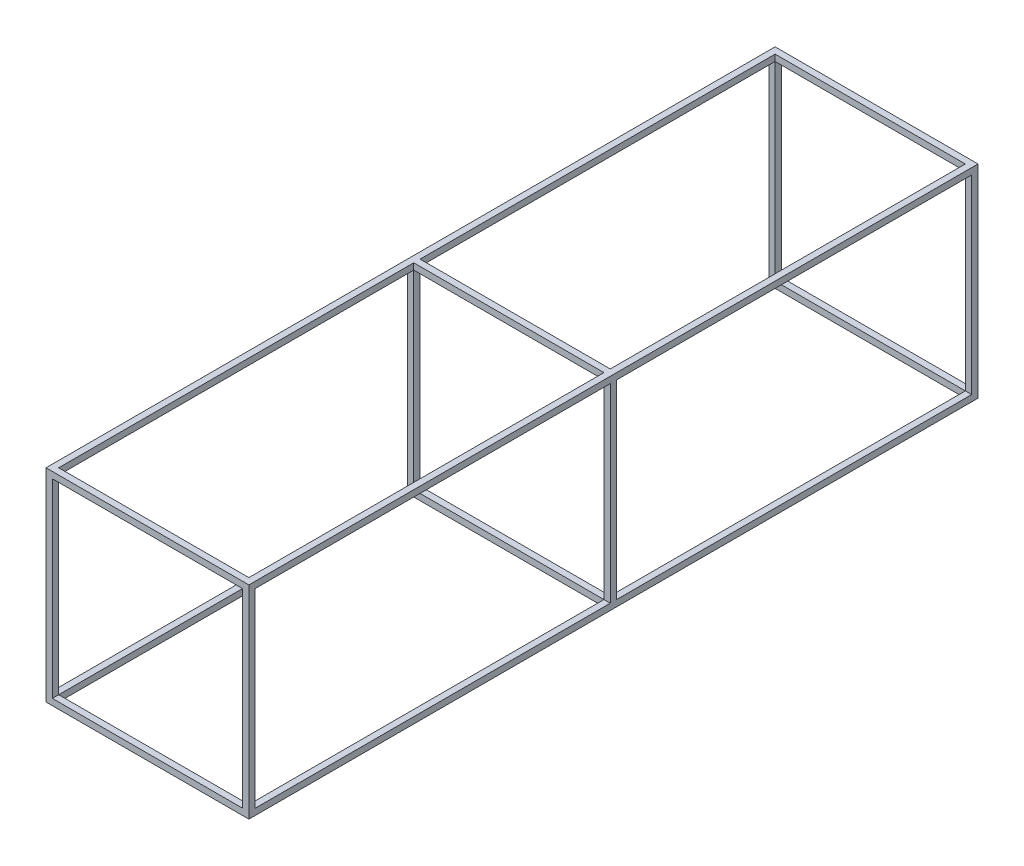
ISO-10303-21;
HEADER;
FILE_DESCRIPTION(('STEP AP214'),'2;1');
FILE_NAME('part.step','',(''),(''),'','','');
FILE_SCHEMA(('AUTOMOTIVE_DESIGN { 1 0 10303 214 1 1 1 1 }'));
ENDSEC;
DATA;
#1=APPLICATION_CONTEXT('core data for automotive mechanical design processes');
#2=APPLICATION_PROTOCOL_DEFINITION('international standard','automotive_design',2000,#1);
#3=PRODUCT_CONTEXT('',#1,'mechanical');
#4=PRODUCT('Part','Part','',(#3));
#5=PRODUCT_RELATED_PRODUCT_CATEGORY('part','',(#4));
#6=PRODUCT_DEFINITION_FORMATION('','',#4);
#7=PRODUCT_DEFINITION_CONTEXT('part definition',#1,'design');
#8=PRODUCT_DEFINITION('design','',#6,#7);
#9=PRODUCT_DEFINITION_SHAPE('','',#8);
#10=(LENGTH_UNIT() NAMED_UNIT(*) SI_UNIT(.MILLI.,.METRE.));
#11=(NAMED_UNIT(*) PLANE_ANGLE_UNIT() SI_UNIT($,.RADIAN.));
#12=(NAMED_UNIT(*) SI_UNIT($,.STERADIAN.) SOLID_ANGLE_UNIT());
#13=UNCERTAINTY_MEASURE_WITH_UNIT(LENGTH_MEASURE(1.E-05),#10,'distance_accuracy_value','');
#14=(GEOMETRIC_REPRESENTATION_CONTEXT(3) GLOBAL_UNCERTAINTY_ASSIGNED_CONTEXT((#13)) GLOBAL_UNIT_ASSIGNED_CONTEXT((#10,
#11,#12)) REPRESENTATION_CONTEXT('',''));
#15=CARTESIAN_POINT('',(0.,0.,0.));
#16=DIRECTION('',(0.,0.,1.));
#17=DIRECTION('',(1.,0.,0.));
#18=AXIS2_PLACEMENT_3D('',#15,#16,#17);
#19=CARTESIAN_POINT('',(0.,155.,-565.));
#20=DIRECTION('',(0.,-1.,0.));
#21=DIRECTION('',(0.,0.,-1.));
#22=AXIS2_PLACEMENT_3D('',#19,#20,#21);
#23=PLANE('',#22);
#24=DIRECTION('',(0.,0.,1.));
#25=VECTOR('',#24,1.);
#26=CARTESIAN_POINT('',(0.,155.,-565.));
#27=LINE('',#26,#25);
#28=CARTESIAN_POINT('',(0.,155.,-280.));
#29=VERTEX_POINT('',#28);
#30=CARTESIAN_POINT('',(0.,155.,0.));
#31=VERTEX_POINT('',#30);
#32=EDGE_CURVE('E61',#29,#31,#27,.T.);
#33=ORIENTED_EDGE('',*,*,#32,.F.);
#34=DIRECTION('',(1.,0.,0.));
#35=VECTOR('',#34,1.);
#36=CARTESIAN_POINT('',(0.,155.,-280.));
#37=LINE('',#36,#35);
#38=CARTESIAN_POINT('',(5.,155.,-280.));
#39=VERTEX_POINT('',#38);
#40=EDGE_CURVE('E501',#29,#39,#37,.T.);
#41=ORIENTED_EDGE('',*,*,#40,.T.);
#42=DIRECTION('',(0.,0.,1.));
#43=VECTOR('',#42,1.);
#44=CARTESIAN_POINT('',(5.,155.,-565.));
#45=LINE('',#44,#43);
#46=CARTESIAN_POINT('',(5.,155.,0.));
#47=VERTEX_POINT('',#46);
#48=EDGE_CURVE('E268',#39,#47,#45,.T.);
#49=ORIENTED_EDGE('',*,*,#48,.T.);
#50=DIRECTION('',(-1.,0.,0.));
#51=VECTOR('',#50,1.);
#52=CARTESIAN_POINT('',(0.,155.,0.));
#53=LINE('',#52,#51);
#54=EDGE_CURVE('E324',#47,#31,#53,.T.);
#55=ORIENTED_EDGE('',*,*,#54,.T.);
#56=EDGE_LOOP('',(#33,#41,#49,#55));
#57=FACE_BOUND('',#56,.T.);
#58=ADVANCED_FACE('F45',(#57),#23,.T.);
#59=CARTESIAN_POINT('',(5.,155.,-565.));
#60=DIRECTION('',(1.,0.,0.));
#61=DIRECTION('',(0.,0.,-1.));
#62=AXIS2_PLACEMENT_3D('',#59,#60,#61);
#63=PLANE('',#62);
#64=ORIENTED_EDGE('',*,*,#48,.F.);
#65=DIRECTION('',(0.,1.,0.));
#66=VECTOR('',#65,1.);
#67=CARTESIAN_POINT('',(5.,155.,-280.));
#68=LINE('',#67,#66);
#69=CARTESIAN_POINT('',(5.,160.,-280.));
#70=VERTEX_POINT('',#69);
#71=EDGE_CURVE('E497',#39,#70,#68,.T.);
#72=ORIENTED_EDGE('',*,*,#71,.T.);
#73=DIRECTION('',(0.,0.,1.));
#74=VECTOR('',#73,1.);
#75=CARTESIAN_POINT('',(5.,160.,-565.));
#76=LINE('',#75,#74);
#77=CARTESIAN_POINT('',(5.,160.,0.));
#78=VERTEX_POINT('',#77);
#79=EDGE_CURVE('E309',#70,#78,#76,.T.);
#80=ORIENTED_EDGE('',*,*,#79,.T.);
#81=DIRECTION('',(0.,-1.,0.));
#82=VECTOR('',#81,1.);
#83=CARTESIAN_POINT('',(5.,0.,0.));
#84=LINE('',#83,#82);
#85=EDGE_CURVE('E330',#78,#47,#84,.T.);
#86=ORIENTED_EDGE('',*,*,#85,.T.);
#87=EDGE_LOOP('',(#64,#72,#80,#86));
#88=FACE_BOUND('',#87,.T.);
#89=ADVANCED_FACE('F788',(#88),#63,.T.);
#90=CARTESIAN_POINT('',(0.,4.99999999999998,-565.));
#91=DIRECTION('',(0.,1.,0.));
#92=DIRECTION('',(-1.,0.,0.));
#93=AXIS2_PLACEMENT_3D('',#90,#91,#92);
#94=PLANE('',#93);
#95=DIRECTION('',(0.,0.,1.));
#96=VECTOR('',#95,1.);
#97=CARTESIAN_POINT('',(5.00000000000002,4.99999999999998,-565.));
#98=LINE('',#97,#96);
#99=CARTESIAN_POINT('',(5.00000000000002,4.99999999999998,-280.));
#100=VERTEX_POINT('',#99);
#101=CARTESIAN_POINT('',(5.00000000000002,4.99999999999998,0.));
#102=VERTEX_POINT('',#101);
#103=EDGE_CURVE('E560',#100,#102,#98,.T.);
#104=ORIENTED_EDGE('',*,*,#103,.F.);
#105=DIRECTION('',(-1.,0.,0.));
#106=VECTOR('',#105,1.);
#107=CARTESIAN_POINT('',(0.,4.99999999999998,-280.));
#108=LINE('',#107,#106);
#109=CARTESIAN_POINT('',(0.,4.99999999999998,-280.));
#110=VERTEX_POINT('',#109);
#111=EDGE_CURVE('E493',#100,#110,#108,.T.);
#112=ORIENTED_EDGE('',*,*,#111,.T.);
#113=DIRECTION('',(0.,0.,1.));
#114=VECTOR('',#113,1.);
#115=CARTESIAN_POINT('',(0.,4.99999999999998,-565.));
#116=LINE('',#115,#114);
#117=CARTESIAN_POINT('',(0.,4.99999999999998,0.));
#118=VERTEX_POINT('',#117);
#119=EDGE_CURVE('E566',#110,#118,#116,.T.);
#120=ORIENTED_EDGE('',*,*,#119,.T.);
#121=DIRECTION('',(1.,0.,0.));
#122=VECTOR('',#121,1.);
#123=CARTESIAN_POINT('',(0.,4.99999999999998,0.));
#124=LINE('',#123,#122);
#125=EDGE_CURVE('E314',#118,#102,#124,.T.);
#126=ORIENTED_EDGE('',*,*,#125,.T.);
#127=EDGE_LOOP('',(#104,#112,#120,#126));
#128=FACE_BOUND('',#127,.T.);
#129=ADVANCED_FACE('F754',(#128),#94,.T.);
#130=CARTESIAN_POINT('',(5.00000000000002,4.99999999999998,-565.));
#131=DIRECTION('',(1.,0.,0.));
#132=DIRECTION('',(0.,1.,0.));
#133=AXIS2_PLACEMENT_3D('',#130,#131,#132);
#134=PLANE('',#133);
#135=DIRECTION('',(0.,0.,1.));
#136=VECTOR('',#135,1.);
#137=CARTESIAN_POINT('',(5.00000000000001,0.,-565.));
#138=LINE('',#137,#136);
#139=CARTESIAN_POINT('',(5.00000000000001,0.,-280.));
#140=VERTEX_POINT('',#139);
#141=CARTESIAN_POINT('',(5.00000000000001,0.,0.));
#142=VERTEX_POINT('',#141);
#143=EDGE_CURVE('E571',#140,#142,#138,.T.);
#144=ORIENTED_EDGE('',*,*,#143,.F.);
#145=DIRECTION('',(0.,1.,0.));
#146=VECTOR('',#145,1.);
#147=CARTESIAN_POINT('',(5.00000000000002,4.99999999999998,-280.));
#148=LINE('',#147,#146);
#149=EDGE_CURVE('E489',#140,#100,#148,.T.);
#150=ORIENTED_EDGE('',*,*,#149,.T.);
#151=ORIENTED_EDGE('',*,*,#103,.T.);
#152=DIRECTION('',(0.,-1.,0.));
#153=VECTOR('',#152,1.);
#154=CARTESIAN_POINT('',(5.00000000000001,0.,0.));
#155=LINE('',#154,#153);
#156=EDGE_CURVE('E318',#102,#142,#155,.T.);
#157=ORIENTED_EDGE('',*,*,#156,.T.);
#158=EDGE_LOOP('',(#144,#150,#151,#157));
#159=FACE_BOUND('',#158,.T.);
#160=ADVANCED_FACE('F586',(#159),#134,.T.);
#161=CARTESIAN_POINT('',(155.,0.,-565.));
#162=DIRECTION('',(-1.,0.,0.));
#163=DIRECTION('',(0.,0.,1.));
#164=AXIS2_PLACEMENT_3D('',#161,#162,#163);
#165=PLANE('',#164);
#166=DIRECTION('',(0.,0.,1.));
#167=VECTOR('',#166,1.);
#168=CARTESIAN_POINT('',(155.,4.99999999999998,-565.));
#169=LINE('',#168,#167);
#170=CARTESIAN_POINT('',(155.,4.99999999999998,-280.));
#171=VERTEX_POINT('',#170);
#172=CARTESIAN_POINT('',(155.,4.99999999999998,0.));
#173=VERTEX_POINT('',#172);
#174=EDGE_CURVE('E531',#171,#173,#169,.T.);
#175=ORIENTED_EDGE('',*,*,#174,.F.);
#176=DIRECTION('',(0.,-1.,0.));
#177=VECTOR('',#176,1.);
#178=CARTESIAN_POINT('',(155.,0.,-280.));
#179=LINE('',#178,#177);
#180=CARTESIAN_POINT('',(155.,0.,-280.));
#181=VERTEX_POINT('',#180);
#182=EDGE_CURVE('E485',#171,#181,#179,.T.);
#183=ORIENTED_EDGE('',*,*,#182,.T.);
#184=DIRECTION('',(0.,0.,1.));
#185=VECTOR('',#184,1.);
#186=CARTESIAN_POINT('',(155.,0.,-565.));
#187=LINE('',#186,#185);
#188=CARTESIAN_POINT('',(155.,0.,0.));
#189=VERTEX_POINT('',#188);
#190=EDGE_CURVE('E537',#181,#189,#187,.T.);
#191=ORIENTED_EDGE('',*,*,#190,.T.);
#192=DIRECTION('',(0.,1.,0.));
#193=VECTOR('',#192,1.);
#194=CARTESIAN_POINT('',(155.,0.,0.));
#195=LINE('',#194,#193);
#196=EDGE_CURVE('E556',#189,#173,#195,.T.);
#197=ORIENTED_EDGE('',*,*,#196,.T.);
#198=EDGE_LOOP('',(#175,#183,#191,#197));
#199=FACE_BOUND('',#198,.T.);
#200=ADVANCED_FACE('F848',(#199),#165,.T.);
#201=CARTESIAN_POINT('',(155.,4.99999999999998,-565.));
#202=DIRECTION('',(0.,1.,0.));
#203=DIRECTION('',(0.,0.,1.));
#204=AXIS2_PLACEMENT_3D('',#201,#202,#203);
#205=PLANE('',#204);
#206=DIRECTION('',(0.,0.,1.));
#207=VECTOR('',#206,1.);
#208=CARTESIAN_POINT('',(160.,4.99999999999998,-565.));
#209=LINE('',#208,#207);
#210=CARTESIAN_POINT('',(160.,4.99999999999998,-280.));
#211=VERTEX_POINT('',#210);
#212=CARTESIAN_POINT('',(160.,4.99999999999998,0.));
#213=VERTEX_POINT('',#212);
#214=EDGE_CURVE('E540',#211,#213,#209,.T.);
#215=ORIENTED_EDGE('',*,*,#214,.F.);
#216=DIRECTION('',(-1.,0.,0.));
#217=VECTOR('',#216,1.);
#218=CARTESIAN_POINT('',(155.,4.99999999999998,-280.));
#219=LINE('',#218,#217);
#220=EDGE_CURVE('E481',#211,#171,#219,.T.);
#221=ORIENTED_EDGE('',*,*,#220,.T.);
#222=ORIENTED_EDGE('',*,*,#174,.T.);
#223=DIRECTION('',(1.,0.,0.));
#224=VECTOR('',#223,1.);
#225=CARTESIAN_POINT('',(0.,4.99999999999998,0.));
#226=LINE('',#225,#224);
#227=EDGE_CURVE('E552',#173,#213,#226,.T.);
#228=ORIENTED_EDGE('',*,*,#227,.T.);
#229=EDGE_LOOP('',(#215,#221,#222,#228));
#230=FACE_BOUND('',#229,.T.);
#231=ADVANCED_FACE('F845',(#230),#205,.T.);
#232=CARTESIAN_POINT('',(155.,160.,-565.));
#233=DIRECTION('',(-1.,0.,0.));
#234=DIRECTION('',(0.,0.,1.));
#235=AXIS2_PLACEMENT_3D('',#232,#233,#234);
#236=PLANE('',#235);
#237=DIRECTION('',(0.,0.,1.));
#238=VECTOR('',#237,1.);
#239=CARTESIAN_POINT('',(155.,160.,-565.));
#240=LINE('',#239,#238);
#241=CARTESIAN_POINT('',(155.,160.,-280.));
#242=VERTEX_POINT('',#241);
#243=CARTESIAN_POINT('',(155.,160.,0.));
#244=VERTEX_POINT('',#243);
#245=EDGE_CURVE('E504',#242,#244,#240,.T.);
#246=ORIENTED_EDGE('',*,*,#245,.F.);
#247=DIRECTION('',(0.,-1.,0.));
#248=VECTOR('',#247,1.);
#249=CARTESIAN_POINT('',(155.,160.,-280.));
#250=LINE('',#249,#248);
#251=CARTESIAN_POINT('',(155.,155.,-280.));
#252=VERTEX_POINT('',#251);
#253=EDGE_CURVE('E478',#242,#252,#250,.T.);
#254=ORIENTED_EDGE('',*,*,#253,.T.);
#255=DIRECTION('',(0.,0.,1.));
#256=VECTOR('',#255,1.);
#257=CARTESIAN_POINT('',(155.,155.,-565.));
#258=LINE('',#257,#256);
#259=CARTESIAN_POINT('',(155.,155.,0.));
#260=VERTEX_POINT('',#259);
#261=EDGE_CURVE('E509',#252,#260,#258,.T.);
#262=ORIENTED_EDGE('',*,*,#261,.T.);
#263=DIRECTION('',(0.,1.,0.));
#264=VECTOR('',#263,1.);
#265=CARTESIAN_POINT('',(155.,0.,0.));
#266=LINE('',#265,#264);
#267=EDGE_CURVE('E527',#260,#244,#266,.T.);
#268=ORIENTED_EDGE('',*,*,#267,.T.);
#269=EDGE_LOOP('',(#246,#254,#262,#268));
#270=FACE_BOUND('',#269,.T.);
#271=ADVANCED_FACE('F794',(#270),#236,.T.);
#272=CARTESIAN_POINT('',(155.,155.,-565.));
#273=DIRECTION('',(0.,-1.,0.));
#274=DIRECTION('',(0.,0.,-1.));
#275=AXIS2_PLACEMENT_3D('',#272,#273,#274);
#276=PLANE('',#275);
#277=ORIENTED_EDGE('',*,*,#261,.F.);
#278=DIRECTION('',(1.,0.,0.));
#279=VECTOR('',#278,1.);
#280=CARTESIAN_POINT('',(155.,155.,-280.));
#281=LINE('',#280,#279);
#282=CARTESIAN_POINT('',(160.,155.,-280.));
#283=VERTEX_POINT('',#282);
#284=EDGE_CURVE('E11',#252,#283,#281,.T.);
#285=ORIENTED_EDGE('',*,*,#284,.T.);
#286=DIRECTION('',(0.,0.,1.));
#287=VECTOR('',#286,1.);
#288=CARTESIAN_POINT('',(160.,155.,-565.));
#289=LINE('',#288,#287);
#290=CARTESIAN_POINT('',(160.,155.,0.));
#291=VERTEX_POINT('',#290);
#292=EDGE_CURVE('E512',#283,#291,#289,.T.);
#293=ORIENTED_EDGE('',*,*,#292,.T.);
#294=DIRECTION('',(-1.,0.,0.));
#295=VECTOR('',#294,1.);
#296=CARTESIAN_POINT('',(0.,155.,0.));
#297=LINE('',#296,#295);
#298=EDGE_CURVE('E523',#291,#260,#297,.T.);
#299=ORIENTED_EDGE('',*,*,#298,.T.);
#300=EDGE_LOOP('',(#277,#285,#293,#299));
#301=FACE_BOUND('',#300,.T.);
#302=ADVANCED_FACE('F853',(#301),#276,.T.);
#303=CARTESIAN_POINT('',(0.,0.,0.));
#304=DIRECTION('',(0.,0.,-1.));
#305=DIRECTION('',(-1.,0.,0.));
#306=AXIS2_PLACEMENT_3D('',#303,#304,#305);
#307=PLANE('',#306);
#308=ORIENTED_EDGE('',*,*,#267,.F.);
#309=DIRECTION('',(-1.,0.,0.));
#310=VECTOR('',#309,1.);
#311=CARTESIAN_POINT('',(155.,155.,0.));
#312=LINE('',#311,#310);
#313=EDGE_CURVE('E334',#260,#47,#312,.T.);
#314=ORIENTED_EDGE('',*,*,#313,.T.);
#315=ORIENTED_EDGE('',*,*,#85,.F.);
#316=DIRECTION('',(-1.,0.,0.));
#317=VECTOR('',#316,1.);
#318=CARTESIAN_POINT('',(0.,160.,0.));
#319=LINE('',#318,#317);
#320=EDGE_CURVE('E401',#244,#78,#319,.T.);
#321=ORIENTED_EDGE('',*,*,#320,.F.);
#322=EDGE_LOOP('',(#308,#314,#315,#321));
#323=FACE_BOUND('',#322,.T.);
#324=ADVANCED_FACE('F776',(#323),#307,.T.);
#325=ORIENTED_EDGE('',*,*,#196,.F.);
#326=DIRECTION('',(1.,0.,0.));
#327=VECTOR('',#326,1.);
#328=CARTESIAN_POINT('',(160.,0.,0.));
#329=LINE('',#328,#327);
#330=EDGE_CURVE('E379',#142,#189,#329,.T.);
#331=ORIENTED_EDGE('',*,*,#330,.F.);
#332=ORIENTED_EDGE('',*,*,#156,.F.);
#333=DIRECTION('',(1.,0.,0.));
#334=VECTOR('',#333,1.);
#335=CARTESIAN_POINT('',(5.00000000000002,4.99999999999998,0.));
#336=LINE('',#335,#334);
#337=EDGE_CURVE('E357',#102,#173,#336,.T.);
#338=ORIENTED_EDGE('',*,*,#337,.T.);
#339=EDGE_LOOP('',(#325,#331,#332,#338));
#340=FACE_BOUND('',#339,.T.);
#341=ADVANCED_FACE('F590',(#340),#307,.T.);
#342=ORIENTED_EDGE('',*,*,#125,.F.);
#343=DIRECTION('',(0.,-1.,0.));
#344=VECTOR('',#343,1.);
#345=CARTESIAN_POINT('',(0.,0.,0.));
#346=LINE('',#345,#344);
#347=EDGE_CURVE('E384',#31,#118,#346,.T.);
#348=ORIENTED_EDGE('',*,*,#347,.F.);
#349=ORIENTED_EDGE('',*,*,#54,.F.);
#350=DIRECTION('',(0.,-1.,0.));
#351=VECTOR('',#350,1.);
#352=CARTESIAN_POINT('',(5.,155.,0.));
#353=LINE('',#352,#351);
#354=EDGE_CURVE('E353',#47,#102,#353,.T.);
#355=ORIENTED_EDGE('',*,*,#354,.T.);
#356=EDGE_LOOP('',(#342,#348,#349,#355));
#357=FACE_BOUND('',#356,.T.);
#358=ADVANCED_FACE('F759',(#357),#307,.T.);
#359=CARTESIAN_POINT('',(0.,0.,5.));
#360=DIRECTION('',(0.,0.,-1.));
#361=DIRECTION('',(-1.,0.,0.));
#362=AXIS2_PLACEMENT_3D('',#359,#360,#361);
#363=PLANE('',#362);
#364=DIRECTION('',(-1.,0.,0.));
#365=VECTOR('',#364,1.);
#366=CARTESIAN_POINT('',(0.,160.,5.));
#367=LINE('',#366,#365);
#368=CARTESIAN_POINT('',(160.,160.,5.));
#369=VERTEX_POINT('',#368);
#370=CARTESIAN_POINT('',(0.,160.,5.));
#371=VERTEX_POINT('',#370);
#372=EDGE_CURVE('E387',#369,#371,#367,.T.);
#373=ORIENTED_EDGE('',*,*,#372,.T.);
#374=DIRECTION('',(0.,-1.,0.));
#375=VECTOR('',#374,1.);
#376=CARTESIAN_POINT('',(0.,0.,5.));
#377=LINE('',#376,#375);
#378=CARTESIAN_POINT('',(0.,0.,5.));
#379=VERTEX_POINT('',#378);
#380=EDGE_CURVE('E390',#371,#379,#377,.T.);
#381=ORIENTED_EDGE('',*,*,#380,.T.);
#382=DIRECTION('',(1.,0.,0.));
#383=VECTOR('',#382,1.);
#384=CARTESIAN_POINT('',(160.,0.,5.));
#385=LINE('',#384,#383);
#386=CARTESIAN_POINT('',(160.,0.,5.));
#387=VERTEX_POINT('',#386);
#388=EDGE_CURVE('E380',#379,#387,#385,.T.);
#389=ORIENTED_EDGE('',*,*,#388,.T.);
#390=DIRECTION('',(0.,1.,0.));
#391=VECTOR('',#390,1.);
#392=CARTESIAN_POINT('',(160.,160.,5.));
#393=LINE('',#392,#391);
#394=EDGE_CURVE('E383',#387,#369,#393,.T.);
#395=ORIENTED_EDGE('',*,*,#394,.T.);
#396=EDGE_LOOP('',(#373,#381,#389,#395));
#397=FACE_BOUND('',#396,.T.);
#398=DIRECTION('',(-1.,0.,0.));
#399=VECTOR('',#398,1.);
#400=CARTESIAN_POINT('',(155.,155.,5.));
#401=LINE('',#400,#399);
#402=CARTESIAN_POINT('',(155.,155.,5.));
#403=VERTEX_POINT('',#402);
#404=CARTESIAN_POINT('',(5.,155.,5.));
#405=VERTEX_POINT('',#404);
#406=EDGE_CURVE('E335',#403,#405,#401,.T.);
#407=ORIENTED_EDGE('',*,*,#406,.F.);
#408=DIRECTION('',(0.,1.,0.));
#409=VECTOR('',#408,1.);
#410=CARTESIAN_POINT('',(155.,4.99999999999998,5.));
#411=LINE('',#410,#409);
#412=CARTESIAN_POINT('',(155.,4.99999999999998,5.));
#413=VERTEX_POINT('',#412);
#414=EDGE_CURVE('E346',#413,#403,#411,.T.);
#415=ORIENTED_EDGE('',*,*,#414,.F.);
#416=DIRECTION('',(1.,0.,0.));
#417=VECTOR('',#416,1.);
#418=CARTESIAN_POINT('',(5.00000000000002,4.99999999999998,5.));
#419=LINE('',#418,#417);
#420=CARTESIAN_POINT('',(5.00000000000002,4.99999999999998,5.));
#421=VERTEX_POINT('',#420);
#422=EDGE_CURVE('E342',#421,#413,#419,.T.);
#423=ORIENTED_EDGE('',*,*,#422,.F.);
#424=DIRECTION('',(0.,-1.,0.));
#425=VECTOR('',#424,1.);
#426=CARTESIAN_POINT('',(5.,155.,5.));
#427=LINE('',#426,#425);
#428=EDGE_CURVE('E338',#405,#421,#427,.T.);
#429=ORIENTED_EDGE('',*,*,#428,.F.);
#430=EDGE_LOOP('',(#407,#415,#423,#429));
#431=FACE_BOUND('',#430,.T.);
#432=ADVANCED_FACE('F809',(#397,#431),#363,.F.);
#433=ORIENTED_EDGE('',*,*,#298,.F.);
#434=DIRECTION('',(0.,1.,0.));
#435=VECTOR('',#434,1.);
#436=CARTESIAN_POINT('',(160.,160.,0.));
#437=LINE('',#436,#435);
#438=EDGE_CURVE('E397',#213,#291,#437,.T.);
#439=ORIENTED_EDGE('',*,*,#438,.F.);
#440=ORIENTED_EDGE('',*,*,#227,.F.);
#441=DIRECTION('',(0.,1.,0.));
#442=VECTOR('',#441,1.);
#443=CARTESIAN_POINT('',(155.,4.99999999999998,0.));
#444=LINE('',#443,#442);
#445=EDGE_CURVE('E339',#173,#260,#444,.T.);
#446=ORIENTED_EDGE('',*,*,#445,.T.);
#447=EDGE_LOOP('',(#433,#439,#440,#446));
#448=FACE_BOUND('',#447,.T.);
#449=ADVANCED_FACE('F803',(#448),#307,.T.);
#450=CARTESIAN_POINT('',(160.,0.,5.));
#451=DIRECTION('',(0.,1.,0.));
#452=DIRECTION('',(-1.,0.,0.));
#453=AXIS2_PLACEMENT_3D('',#450,#451,#452);
#454=PLANE('',#453);
#455=DIRECTION('',(1.,0.,0.));
#456=VECTOR('',#455,1.);
#457=CARTESIAN_POINT('',(160.,0.,-565.));
#458=LINE('',#457,#456);
#459=CARTESIAN_POINT('',(5.,0.,-565.));
#460=VERTEX_POINT('',#459);
#461=CARTESIAN_POINT('',(155.,0.,-565.));
#462=VERTEX_POINT('',#461);
#463=EDGE_CURVE('E667',#460,#462,#458,.T.);
#464=ORIENTED_EDGE('',*,*,#463,.F.);
#465=CARTESIAN_POINT('',(5.,0.,-285.));
#466=VERTEX_POINT('',#465);
#467=EDGE_CURVE('E567',#460,#466,#138,.T.);
#468=ORIENTED_EDGE('',*,*,#467,.T.);
#469=DIRECTION('',(1.,0.,0.));
#470=VECTOR('',#469,1.);
#471=CARTESIAN_POINT('',(160.,0.,-285.));
#472=LINE('',#471,#470);
#473=CARTESIAN_POINT('',(155.,0.,-285.));
#474=VERTEX_POINT('',#473);
#475=EDGE_CURVE('E441',#466,#474,#472,.T.);
#476=ORIENTED_EDGE('',*,*,#475,.T.);
#477=EDGE_CURVE('E532',#462,#474,#187,.T.);
#478=ORIENTED_EDGE('',*,*,#477,.F.);
#479=EDGE_LOOP('',(#464,#468,#476,#478));
#480=FACE_BOUND('',#479,.T.);
#481=ORIENTED_EDGE('',*,*,#190,.F.);
#482=DIRECTION('',(1.,0.,0.));
#483=VECTOR('',#482,1.);
#484=CARTESIAN_POINT('',(160.,0.,-280.));
#485=LINE('',#484,#483);
#486=EDGE_CURVE('E456',#140,#181,#485,.T.);
#487=ORIENTED_EDGE('',*,*,#486,.F.);
#488=ORIENTED_EDGE('',*,*,#143,.T.);
#489=ORIENTED_EDGE('',*,*,#330,.T.);
#490=EDGE_LOOP('',(#481,#487,#488,#489));
#491=FACE_BOUND('',#490,.T.);
#492=DIRECTION('',(0.,0.,-1.));
#493=VECTOR('',#492,1.);
#494=CARTESIAN_POINT('',(0.,0.,5.));
#495=LINE('',#494,#493);
#496=CARTESIAN_POINT('',(0.,0.,-570.));
#497=VERTEX_POINT('',#496);
#498=EDGE_CURVE('E393',#379,#497,#495,.T.);
#499=ORIENTED_EDGE('',*,*,#498,.T.);
#500=DIRECTION('',(1.,0.,0.));
#501=VECTOR('',#500,1.);
#502=CARTESIAN_POINT('',(160.,0.,-570.));
#503=LINE('',#502,#501);
#504=CARTESIAN_POINT('',(160.,0.,-570.));
#505=VERTEX_POINT('',#504);
#506=EDGE_CURVE('E292',#497,#505,#503,.T.);
#507=ORIENTED_EDGE('',*,*,#506,.T.);
#508=DIRECTION('',(0.,0.,-1.));
#509=VECTOR('',#508,1.);
#510=CARTESIAN_POINT('',(160.,0.,5.));
#511=LINE('',#510,#509);
#512=EDGE_CURVE('E416',#387,#505,#511,.T.);
#513=ORIENTED_EDGE('',*,*,#512,.F.);
#514=ORIENTED_EDGE('',*,*,#388,.F.);
#515=EDGE_LOOP('',(#499,#507,#513,#514));
#516=FACE_BOUND('',#515,.T.);
#517=ADVANCED_FACE('F47',(#480,#491,#516),#454,.F.);
#518=CARTESIAN_POINT('',(160.,160.,5.));
#519=DIRECTION('',(-1.,0.,0.));
#520=DIRECTION('',(0.,-1.,0.));
#521=AXIS2_PLACEMENT_3D('',#518,#519,#520);
#522=PLANE('',#521);
#523=DIRECTION('',(0.,1.,0.));
#524=VECTOR('',#523,1.);
#525=CARTESIAN_POINT('',(160.,160.,-565.));
#526=LINE('',#525,#524);
#527=CARTESIAN_POINT('',(160.,4.99999999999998,-565.));
#528=VERTEX_POINT('',#527);
#529=CARTESIAN_POINT('',(160.,155.,-565.));
#530=VERTEX_POINT('',#529);
#531=EDGE_CURVE('E683',#528,#530,#526,.T.);
#532=ORIENTED_EDGE('',*,*,#531,.F.);
#533=CARTESIAN_POINT('',(160.,4.99999999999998,-285.));
#534=VERTEX_POINT('',#533);
#535=EDGE_CURVE('E438',#528,#534,#209,.T.);
#536=ORIENTED_EDGE('',*,*,#535,.T.);
#537=DIRECTION('',(0.,1.,0.));
#538=VECTOR('',#537,1.);
#539=CARTESIAN_POINT('',(160.,160.,-285.));
#540=LINE('',#539,#538);
#541=CARTESIAN_POINT('',(160.,155.,-285.));
#542=VERTEX_POINT('',#541);
#543=EDGE_CURVE('E424',#534,#542,#540,.T.);
#544=ORIENTED_EDGE('',*,*,#543,.T.);
#545=EDGE_CURVE('E435',#530,#542,#289,.T.);
#546=ORIENTED_EDGE('',*,*,#545,.F.);
#547=EDGE_LOOP('',(#532,#536,#544,#546));
#548=FACE_BOUND('',#547,.T.);
#549=ORIENTED_EDGE('',*,*,#292,.F.);
#550=DIRECTION('',(0.,1.,0.));
#551=VECTOR('',#550,1.);
#552=CARTESIAN_POINT('',(160.,160.,-280.));
#553=LINE('',#552,#551);
#554=EDGE_CURVE('E609',#211,#283,#553,.T.);
#555=ORIENTED_EDGE('',*,*,#554,.F.);
#556=ORIENTED_EDGE('',*,*,#214,.T.);
#557=ORIENTED_EDGE('',*,*,#438,.T.);
#558=EDGE_LOOP('',(#549,#555,#556,#557));
#559=FACE_BOUND('',#558,.T.);
#560=ORIENTED_EDGE('',*,*,#512,.T.);
#561=DIRECTION('',(0.,1.,0.));
#562=VECTOR('',#561,1.);
#563=CARTESIAN_POINT('',(160.,160.,-570.));
#564=LINE('',#563,#562);
#565=CARTESIAN_POINT('',(160.,160.,-570.));
#566=VERTEX_POINT('',#565);
#567=EDGE_CURVE('E672',#505,#566,#564,.T.);
#568=ORIENTED_EDGE('',*,*,#567,.T.);
#569=DIRECTION('',(0.,0.,-1.));
#570=VECTOR('',#569,1.);
#571=CARTESIAN_POINT('',(160.,160.,5.));
#572=LINE('',#571,#570);
#573=EDGE_CURVE('E413',#369,#566,#572,.T.);
#574=ORIENTED_EDGE('',*,*,#573,.F.);
#575=ORIENTED_EDGE('',*,*,#394,.F.);
#576=EDGE_LOOP('',(#560,#568,#574,#575));
#577=FACE_BOUND('',#576,.T.);
#578=ADVANCED_FACE('F433',(#548,#559,#577),#522,.F.);
#579=CARTESIAN_POINT('',(0.,160.,5.));
#580=DIRECTION('',(0.,-1.,0.));
#581=DIRECTION('',(0.,0.,-1.));
#582=AXIS2_PLACEMENT_3D('',#579,#580,#581);
#583=PLANE('',#582);
#584=DIRECTION('',(-1.,0.,0.));
#585=VECTOR('',#584,1.);
#586=CARTESIAN_POINT('',(0.,160.,-570.));
#587=LINE('',#586,#585);
#588=CARTESIAN_POINT('',(0.,160.,-570.));
#589=VERTEX_POINT('',#588);
#590=EDGE_CURVE('E668',#566,#589,#587,.T.);
#591=ORIENTED_EDGE('',*,*,#590,.T.);
#592=DIRECTION('',(0.,0.,-1.));
#593=VECTOR('',#592,1.);
#594=CARTESIAN_POINT('',(0.,160.,5.));
#595=LINE('',#594,#593);
#596=EDGE_CURVE('E410',#371,#589,#595,.T.);
#597=ORIENTED_EDGE('',*,*,#596,.F.);
#598=ORIENTED_EDGE('',*,*,#372,.F.);
#599=ORIENTED_EDGE('',*,*,#573,.T.);
#600=EDGE_LOOP('',(#591,#597,#598,#599));
#601=FACE_BOUND('',#600,.T.);
#602=ORIENTED_EDGE('',*,*,#79,.F.);
#603=DIRECTION('',(-1.,0.,0.));
#604=VECTOR('',#603,1.);
#605=CARTESIAN_POINT('',(0.,160.,-280.));
#606=LINE('',#605,#604);
#607=EDGE_CURVE('E606',#242,#70,#606,.T.);
#608=ORIENTED_EDGE('',*,*,#607,.F.);
#609=ORIENTED_EDGE('',*,*,#245,.T.);
#610=ORIENTED_EDGE('',*,*,#320,.T.);
#611=EDGE_LOOP('',(#602,#608,#609,#610));
#612=FACE_BOUND('',#611,.T.);
#613=CARTESIAN_POINT('',(155.,160.,-565.));
#614=VERTEX_POINT('',#613);
#615=CARTESIAN_POINT('',(155.,160.,-285.));
#616=VERTEX_POINT('',#615);
#617=EDGE_CURVE('E513',#614,#616,#240,.T.);
#618=ORIENTED_EDGE('',*,*,#617,.T.);
#619=DIRECTION('',(-1.,0.,0.));
#620=VECTOR('',#619,1.);
#621=CARTESIAN_POINT('',(0.,160.,-285.));
#622=LINE('',#621,#620);
#623=CARTESIAN_POINT('',(5.,160.,-285.));
#624=VERTEX_POINT('',#623);
#625=EDGE_CURVE('E440',#616,#624,#622,.T.);
#626=ORIENTED_EDGE('',*,*,#625,.T.);
#627=CARTESIAN_POINT('',(5.,160.,-565.));
#628=VERTEX_POINT('',#627);
#629=EDGE_CURVE('E325',#628,#624,#76,.T.);
#630=ORIENTED_EDGE('',*,*,#629,.F.);
#631=DIRECTION('',(-1.,0.,0.));
#632=VECTOR('',#631,1.);
#633=CARTESIAN_POINT('',(0.,160.,-565.));
#634=LINE('',#633,#632);
#635=EDGE_CURVE('E263',#614,#628,#634,.T.);
#636=ORIENTED_EDGE('',*,*,#635,.F.);
#637=EDGE_LOOP('',(#618,#626,#630,#636));
#638=FACE_BOUND('',#637,.T.);
#639=ADVANCED_FACE('F791',(#601,#612,#638),#583,.F.);
#640=CARTESIAN_POINT('',(0.,0.,5.));
#641=DIRECTION('',(1.,0.,0.));
#642=DIRECTION('',(0.,0.,-1.));
#643=AXIS2_PLACEMENT_3D('',#640,#641,#642);
#644=PLANE('',#643);
#645=DIRECTION('',(0.,-1.,0.));
#646=VECTOR('',#645,1.);
#647=CARTESIAN_POINT('',(0.,0.,-565.));
#648=LINE('',#647,#646);
#649=CARTESIAN_POINT('',(0.,155.,-565.));
#650=VERTEX_POINT('',#649);
#651=CARTESIAN_POINT('',(0.,4.99999999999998,-565.));
#652=VERTEX_POINT('',#651);
#653=EDGE_CURVE('E648',#650,#652,#648,.T.);
#654=ORIENTED_EDGE('',*,*,#653,.F.);
#655=CARTESIAN_POINT('',(0.,155.,-285.));
#656=VERTEX_POINT('',#655);
#657=EDGE_CURVE('E312',#650,#656,#27,.T.);
#658=ORIENTED_EDGE('',*,*,#657,.T.);
#659=DIRECTION('',(0.,-1.,0.));
#660=VECTOR('',#659,1.);
#661=CARTESIAN_POINT('',(0.,0.,-285.));
#662=LINE('',#661,#660);
#663=CARTESIAN_POINT('',(0.,4.99999999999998,-285.));
#664=VERTEX_POINT('',#663);
#665=EDGE_CURVE('E446',#656,#664,#662,.T.);
#666=ORIENTED_EDGE('',*,*,#665,.T.);
#667=EDGE_CURVE('E561',#652,#664,#116,.T.);
#668=ORIENTED_EDGE('',*,*,#667,.F.);
#669=EDGE_LOOP('',(#654,#658,#666,#668));
#670=FACE_BOUND('',#669,.T.);
#671=ORIENTED_EDGE('',*,*,#119,.F.);
#672=DIRECTION('',(0.,-1.,0.));
#673=VECTOR('',#672,1.);
#674=CARTESIAN_POINT('',(0.,0.,-280.));
#675=LINE('',#674,#673);
#676=EDGE_CURVE('E462',#29,#110,#675,.T.);
#677=ORIENTED_EDGE('',*,*,#676,.F.);
#678=ORIENTED_EDGE('',*,*,#32,.T.);
#679=ORIENTED_EDGE('',*,*,#347,.T.);
#680=EDGE_LOOP('',(#671,#677,#678,#679));
#681=FACE_BOUND('',#680,.T.);
#682=ORIENTED_EDGE('',*,*,#596,.T.);
#683=DIRECTION('',(0.,-1.,0.));
#684=VECTOR('',#683,1.);
#685=CARTESIAN_POINT('',(0.,0.,-570.));
#686=LINE('',#685,#684);
#687=EDGE_CURVE('E663',#589,#497,#686,.T.);
#688=ORIENTED_EDGE('',*,*,#687,.T.);
#689=ORIENTED_EDGE('',*,*,#498,.F.);
#690=ORIENTED_EDGE('',*,*,#380,.F.);
#691=EDGE_LOOP('',(#682,#688,#689,#690));
#692=FACE_BOUND('',#691,.T.);
#693=ADVANCED_FACE('F763',(#670,#681,#692),#644,.F.);
#694=CARTESIAN_POINT('',(155.,155.,5.));
#695=DIRECTION('',(0.,-1.,0.));
#696=DIRECTION('',(1.,0.,0.));
#697=AXIS2_PLACEMENT_3D('',#694,#695,#696);
#698=PLANE('',#697);
#699=ORIENTED_EDGE('',*,*,#313,.F.);
#700=DIRECTION('',(0.,0.,-1.));
#701=VECTOR('',#700,1.);
#702=CARTESIAN_POINT('',(155.,155.,5.));
#703=LINE('',#702,#701);
#704=EDGE_CURVE('E349',#403,#260,#703,.T.);
#705=ORIENTED_EDGE('',*,*,#704,.F.);
#706=ORIENTED_EDGE('',*,*,#406,.T.);
#707=DIRECTION('',(0.,0.,-1.));
#708=VECTOR('',#707,1.);
#709=CARTESIAN_POINT('',(5.,155.,5.));
#710=LINE('',#709,#708);
#711=EDGE_CURVE('E375',#405,#47,#710,.T.);
#712=ORIENTED_EDGE('',*,*,#711,.T.);
#713=EDGE_LOOP('',(#699,#705,#706,#712));
#714=FACE_BOUND('',#713,.T.);
#715=ADVANCED_FACE('F781',(#714),#698,.T.);
#716=CARTESIAN_POINT('',(5.,155.,5.));
#717=DIRECTION('',(1.,0.,0.));
#718=DIRECTION('',(0.,1.,0.));
#719=AXIS2_PLACEMENT_3D('',#716,#717,#718);
#720=PLANE('',#719);
#721=ORIENTED_EDGE('',*,*,#354,.F.);
#722=ORIENTED_EDGE('',*,*,#711,.F.);
#723=ORIENTED_EDGE('',*,*,#428,.T.);
#724=DIRECTION('',(0.,0.,-1.));
#725=VECTOR('',#724,1.);
#726=CARTESIAN_POINT('',(5.00000000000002,4.99999999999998,5.));
#727=LINE('',#726,#725);
#728=EDGE_CURVE('E371',#421,#102,#727,.T.);
#729=ORIENTED_EDGE('',*,*,#728,.T.);
#730=EDGE_LOOP('',(#721,#722,#723,#729));
#731=FACE_BOUND('',#730,.T.);
#732=ADVANCED_FACE('F785',(#731),#720,.T.);
#733=CARTESIAN_POINT('',(5.00000000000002,4.99999999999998,5.));
#734=DIRECTION('',(0.,1.,0.));
#735=DIRECTION('',(0.,0.,1.));
#736=AXIS2_PLACEMENT_3D('',#733,#734,#735);
#737=PLANE('',#736);
#738=ORIENTED_EDGE('',*,*,#337,.F.);
#739=ORIENTED_EDGE('',*,*,#728,.F.);
#740=ORIENTED_EDGE('',*,*,#422,.T.);
#741=DIRECTION('',(0.,0.,-1.));
#742=VECTOR('',#741,1.);
#743=CARTESIAN_POINT('',(155.,4.99999999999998,5.));
#744=LINE('',#743,#742);
#745=EDGE_CURVE('E367',#413,#173,#744,.T.);
#746=ORIENTED_EDGE('',*,*,#745,.T.);
#747=EDGE_LOOP('',(#738,#739,#740,#746));
#748=FACE_BOUND('',#747,.T.);
#749=ADVANCED_FACE('F812',(#748),#737,.T.);
#750=CARTESIAN_POINT('',(155.,4.99999999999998,5.));
#751=DIRECTION('',(-1.,0.,0.));
#752=DIRECTION('',(0.,0.,1.));
#753=AXIS2_PLACEMENT_3D('',#750,#751,#752);
#754=PLANE('',#753);
#755=ORIENTED_EDGE('',*,*,#445,.F.);
#756=ORIENTED_EDGE('',*,*,#745,.F.);
#757=ORIENTED_EDGE('',*,*,#414,.T.);
#758=ORIENTED_EDGE('',*,*,#704,.T.);
#759=EDGE_LOOP('',(#755,#756,#757,#758));
#760=FACE_BOUND('',#759,.T.);
#761=ADVANCED_FACE('F806',(#760),#754,.T.);
#762=DIRECTION('',(1.,0.,0.));
#763=VECTOR('',#762,1.);
#764=CARTESIAN_POINT('',(0.,155.,-285.));
#765=LINE('',#764,#763);
#766=CARTESIAN_POINT('',(5.,155.,-285.));
#767=VERTEX_POINT('',#766);
#768=EDGE_CURVE('E69',#656,#767,#765,.T.);
#769=ORIENTED_EDGE('',*,*,#768,.F.);
#770=ORIENTED_EDGE('',*,*,#657,.F.);
#771=DIRECTION('',(1.,0.,0.));
#772=VECTOR('',#771,1.);
#773=CARTESIAN_POINT('',(0.,155.,-565.));
#774=LINE('',#773,#772);
#775=CARTESIAN_POINT('',(5.,155.,-565.));
#776=VERTEX_POINT('',#775);
#777=EDGE_CURVE('E269',#650,#776,#774,.T.);
#778=ORIENTED_EDGE('',*,*,#777,.T.);
#779=EDGE_CURVE('E304',#776,#767,#45,.T.);
#780=ORIENTED_EDGE('',*,*,#779,.T.);
#781=EDGE_LOOP('',(#769,#770,#778,#780));
#782=FACE_BOUND('',#781,.T.);
#783=ADVANCED_FACE('F311',(#782),#23,.T.);
#784=DIRECTION('',(0.,1.,0.));
#785=VECTOR('',#784,1.);
#786=CARTESIAN_POINT('',(5.,155.,-285.));
#787=LINE('',#786,#785);
#788=EDGE_CURVE('E307',#767,#624,#787,.T.);
#789=ORIENTED_EDGE('',*,*,#788,.F.);
#790=ORIENTED_EDGE('',*,*,#779,.F.);
#791=DIRECTION('',(0.,1.,0.));
#792=VECTOR('',#791,1.);
#793=CARTESIAN_POINT('',(5.,155.,-565.));
#794=LINE('',#793,#792);
#795=EDGE_CURVE('E257',#776,#628,#794,.T.);
#796=ORIENTED_EDGE('',*,*,#795,.T.);
#797=ORIENTED_EDGE('',*,*,#629,.T.);
#798=EDGE_LOOP('',(#789,#790,#796,#797));
#799=FACE_BOUND('',#798,.T.);
#800=ADVANCED_FACE('F305',(#799),#63,.T.);
#801=DIRECTION('',(-1.,0.,0.));
#802=VECTOR('',#801,1.);
#803=CARTESIAN_POINT('',(0.,4.99999999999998,-285.));
#804=LINE('',#803,#802);
#805=CARTESIAN_POINT('',(5.00000000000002,4.99999999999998,-285.));
#806=VERTEX_POINT('',#805);
#807=EDGE_CURVE('E471',#806,#664,#804,.T.);
#808=ORIENTED_EDGE('',*,*,#807,.F.);
#809=CARTESIAN_POINT('',(5.00000000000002,4.99999999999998,-565.));
#810=VERTEX_POINT('',#809);
#811=EDGE_CURVE('E572',#810,#806,#98,.T.);
#812=ORIENTED_EDGE('',*,*,#811,.F.);
#813=DIRECTION('',(-1.,0.,0.));
#814=VECTOR('',#813,1.);
#815=CARTESIAN_POINT('',(0.,4.99999999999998,-565.));
#816=LINE('',#815,#814);
#817=EDGE_CURVE('E300',#810,#652,#816,.T.);
#818=ORIENTED_EDGE('',*,*,#817,.T.);
#819=ORIENTED_EDGE('',*,*,#667,.T.);
#820=EDGE_LOOP('',(#808,#812,#818,#819));
#821=FACE_BOUND('',#820,.T.);
#822=ADVANCED_FACE('F832',(#821),#94,.T.);
#823=DIRECTION('',(0.,1.,0.));
#824=VECTOR('',#823,1.);
#825=CARTESIAN_POINT('',(5.00000000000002,4.99999999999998,-285.));
#826=LINE('',#825,#824);
#827=EDGE_CURVE('E468',#466,#806,#826,.T.);
#828=ORIENTED_EDGE('',*,*,#827,.F.);
#829=ORIENTED_EDGE('',*,*,#467,.F.);
#830=DIRECTION('',(0.,1.,0.));
#831=VECTOR('',#830,1.);
#832=CARTESIAN_POINT('',(5.00000000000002,4.99999999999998,-565.));
#833=LINE('',#832,#831);
#834=EDGE_CURVE('E565',#460,#810,#833,.T.);
#835=ORIENTED_EDGE('',*,*,#834,.T.);
#836=ORIENTED_EDGE('',*,*,#811,.T.);
#837=EDGE_LOOP('',(#828,#829,#835,#836));
#838=FACE_BOUND('',#837,.T.);
#839=ADVANCED_FACE('F836',(#838),#134,.T.);
#840=DIRECTION('',(0.,-1.,0.));
#841=VECTOR('',#840,1.);
#842=CARTESIAN_POINT('',(155.,0.,-285.));
#843=LINE('',#842,#841);
#844=CARTESIAN_POINT('',(155.,4.99999999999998,-285.));
#845=VERTEX_POINT('',#844);
#846=EDGE_CURVE('E465',#845,#474,#843,.T.);
#847=ORIENTED_EDGE('',*,*,#846,.F.);
#848=CARTESIAN_POINT('',(155.,4.99999999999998,-565.));
#849=VERTEX_POINT('',#848);
#850=EDGE_CURVE('E541',#849,#845,#169,.T.);
#851=ORIENTED_EDGE('',*,*,#850,.F.);
#852=DIRECTION('',(0.,-1.,0.));
#853=VECTOR('',#852,1.);
#854=CARTESIAN_POINT('',(155.,0.,-565.));
#855=LINE('',#854,#853);
#856=EDGE_CURVE('E548',#849,#462,#855,.T.);
#857=ORIENTED_EDGE('',*,*,#856,.T.);
#858=ORIENTED_EDGE('',*,*,#477,.T.);
#859=EDGE_LOOP('',(#847,#851,#857,#858));
#860=FACE_BOUND('',#859,.T.);
#861=ADVANCED_FACE('F729',(#860),#165,.T.);
#862=DIRECTION('',(-1.,0.,0.));
#863=VECTOR('',#862,1.);
#864=CARTESIAN_POINT('',(155.,4.99999999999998,-285.));
#865=LINE('',#864,#863);
#866=EDGE_CURVE('E461',#534,#845,#865,.T.);
#867=ORIENTED_EDGE('',*,*,#866,.F.);
#868=ORIENTED_EDGE('',*,*,#535,.F.);
#869=DIRECTION('',(-1.,0.,0.));
#870=VECTOR('',#869,1.);
#871=CARTESIAN_POINT('',(155.,4.99999999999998,-565.));
#872=LINE('',#871,#870);
#873=EDGE_CURVE('E536',#528,#849,#872,.T.);
#874=ORIENTED_EDGE('',*,*,#873,.T.);
#875=ORIENTED_EDGE('',*,*,#850,.T.);
#876=EDGE_LOOP('',(#867,#868,#874,#875));
#877=FACE_BOUND('',#876,.T.);
#878=ADVANCED_FACE('F731',(#877),#205,.T.);
#879=DIRECTION('',(0.,-1.,0.));
#880=VECTOR('',#879,1.);
#881=CARTESIAN_POINT('',(155.,160.,-285.));
#882=LINE('',#881,#880);
#883=CARTESIAN_POINT('',(155.,155.,-285.));
#884=VERTEX_POINT('',#883);
#885=EDGE_CURVE('E457',#616,#884,#882,.T.);
#886=ORIENTED_EDGE('',*,*,#885,.F.);
#887=ORIENTED_EDGE('',*,*,#617,.F.);
#888=DIRECTION('',(0.,-1.,0.));
#889=VECTOR('',#888,1.);
#890=CARTESIAN_POINT('',(155.,160.,-565.));
#891=LINE('',#890,#889);
#892=CARTESIAN_POINT('',(155.,155.,-565.));
#893=VERTEX_POINT('',#892);
#894=EDGE_CURVE('E519',#614,#893,#891,.T.);
#895=ORIENTED_EDGE('',*,*,#894,.T.);
#896=EDGE_CURVE('E505',#893,#884,#258,.T.);
#897=ORIENTED_EDGE('',*,*,#896,.T.);
#898=EDGE_LOOP('',(#886,#887,#895,#897));
#899=FACE_BOUND('',#898,.T.);
#900=ADVANCED_FACE('F844',(#899),#236,.T.);
#901=DIRECTION('',(1.,0.,0.));
#902=VECTOR('',#901,1.);
#903=CARTESIAN_POINT('',(155.,155.,-285.));
#904=LINE('',#903,#902);
#905=EDGE_CURVE('E54',#884,#542,#904,.T.);
#906=ORIENTED_EDGE('',*,*,#905,.F.);
#907=ORIENTED_EDGE('',*,*,#896,.F.);
#908=DIRECTION('',(1.,0.,0.));
#909=VECTOR('',#908,1.);
#910=CARTESIAN_POINT('',(155.,155.,-565.));
#911=LINE('',#910,#909);
#912=EDGE_CURVE('E508',#893,#530,#911,.T.);
#913=ORIENTED_EDGE('',*,*,#912,.T.);
#914=ORIENTED_EDGE('',*,*,#545,.T.);
#915=EDGE_LOOP('',(#906,#907,#913,#914));
#916=FACE_BOUND('',#915,.T.);
#917=ADVANCED_FACE('F849',(#916),#276,.T.);
#918=CARTESIAN_POINT('',(0.,0.,-280.));
#919=DIRECTION('',(0.,0.,-1.));
#920=DIRECTION('',(-1.,0.,0.));
#921=AXIS2_PLACEMENT_3D('',#918,#919,#920);
#922=PLANE('',#921);
#923=ORIENTED_EDGE('',*,*,#40,.F.);
#924=ORIENTED_EDGE('',*,*,#676,.T.);
#925=ORIENTED_EDGE('',*,*,#111,.F.);
#926=DIRECTION('',(0.,-1.,0.));
#927=VECTOR('',#926,1.);
#928=CARTESIAN_POINT('',(5.,155.,-280.));
#929=LINE('',#928,#927);
#930=EDGE_CURVE('E656',#39,#100,#929,.T.);
#931=ORIENTED_EDGE('',*,*,#930,.F.);
#932=EDGE_LOOP('',(#923,#924,#925,#931));
#933=FACE_BOUND('',#932,.T.);
#934=ADVANCED_FACE('F852',(#933),#922,.F.);
#935=ORIENTED_EDGE('',*,*,#71,.F.);
#936=DIRECTION('',(-1.,0.,0.));
#937=VECTOR('',#936,1.);
#938=CARTESIAN_POINT('',(155.,155.,-280.));
#939=LINE('',#938,#937);
#940=EDGE_CURVE('E635',#252,#39,#939,.T.);
#941=ORIENTED_EDGE('',*,*,#940,.F.);
#942=ORIENTED_EDGE('',*,*,#253,.F.);
#943=ORIENTED_EDGE('',*,*,#607,.T.);
#944=EDGE_LOOP('',(#935,#941,#942,#943));
#945=FACE_BOUND('',#944,.T.);
#946=ADVANCED_FACE('F993',(#945),#922,.F.);
#947=ORIENTED_EDGE('',*,*,#149,.F.);
#948=ORIENTED_EDGE('',*,*,#486,.T.);
#949=ORIENTED_EDGE('',*,*,#182,.F.);
#950=DIRECTION('',(1.,0.,0.));
#951=VECTOR('',#950,1.);
#952=CARTESIAN_POINT('',(5.00000000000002,4.99999999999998,-280.));
#953=LINE('',#952,#951);
#954=EDGE_CURVE('E652',#100,#171,#953,.T.);
#955=ORIENTED_EDGE('',*,*,#954,.F.);
#956=EDGE_LOOP('',(#947,#948,#949,#955));
#957=FACE_BOUND('',#956,.T.);
#958=ADVANCED_FACE('F752',(#957),#922,.F.);
#959=CARTESIAN_POINT('',(0.,0.,-285.));
#960=DIRECTION('',(0.,0.,-1.));
#961=DIRECTION('',(-1.,0.,0.));
#962=AXIS2_PLACEMENT_3D('',#959,#960,#961);
#963=PLANE('',#962);
#964=ORIENTED_EDGE('',*,*,#665,.F.);
#965=ORIENTED_EDGE('',*,*,#768,.T.);
#966=DIRECTION('',(0.,-1.,0.));
#967=VECTOR('',#966,1.);
#968=CARTESIAN_POINT('',(5.,155.,-285.));
#969=LINE('',#968,#967);
#970=EDGE_CURVE('E640',#767,#806,#969,.T.);
#971=ORIENTED_EDGE('',*,*,#970,.T.);
#972=ORIENTED_EDGE('',*,*,#807,.T.);
#973=EDGE_LOOP('',(#964,#965,#971,#972));
#974=FACE_BOUND('',#973,.T.);
#975=ADVANCED_FACE('F861',(#974),#963,.T.);
#976=DIRECTION('',(-1.,0.,0.));
#977=VECTOR('',#976,1.);
#978=CARTESIAN_POINT('',(155.,155.,-285.));
#979=LINE('',#978,#977);
#980=EDGE_CURVE('E644',#884,#767,#979,.T.);
#981=ORIENTED_EDGE('',*,*,#980,.T.);
#982=ORIENTED_EDGE('',*,*,#788,.T.);
#983=ORIENTED_EDGE('',*,*,#625,.F.);
#984=ORIENTED_EDGE('',*,*,#885,.T.);
#985=EDGE_LOOP('',(#981,#982,#983,#984));
#986=FACE_BOUND('',#985,.T.);
#987=ADVANCED_FACE('F972',(#986),#963,.T.);
#988=ORIENTED_EDGE('',*,*,#475,.F.);
#989=ORIENTED_EDGE('',*,*,#827,.T.);
#990=DIRECTION('',(1.,0.,0.));
#991=VECTOR('',#990,1.);
#992=CARTESIAN_POINT('',(5.00000000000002,4.99999999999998,-285.));
#993=LINE('',#992,#991);
#994=EDGE_CURVE('E636',#806,#845,#993,.T.);
#995=ORIENTED_EDGE('',*,*,#994,.T.);
#996=ORIENTED_EDGE('',*,*,#846,.T.);
#997=EDGE_LOOP('',(#988,#989,#995,#996));
#998=FACE_BOUND('',#997,.T.);
#999=ADVANCED_FACE('F743',(#998),#963,.T.);
#1000=ORIENTED_EDGE('',*,*,#220,.F.);
#1001=ORIENTED_EDGE('',*,*,#554,.T.);
#1002=ORIENTED_EDGE('',*,*,#284,.F.);
#1003=DIRECTION('',(0.,1.,0.));
#1004=VECTOR('',#1003,1.);
#1005=CARTESIAN_POINT('',(155.,4.99999999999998,-280.));
#1006=LINE('',#1005,#1004);
#1007=EDGE_CURVE('E632',#171,#252,#1006,.T.);
#1008=ORIENTED_EDGE('',*,*,#1007,.F.);
#1009=EDGE_LOOP('',(#1000,#1001,#1002,#1008));
#1010=FACE_BOUND('',#1009,.T.);
#1011=ADVANCED_FACE('F860',(#1010),#922,.F.);
#1012=ORIENTED_EDGE('',*,*,#543,.F.);
#1013=ORIENTED_EDGE('',*,*,#866,.T.);
#1014=DIRECTION('',(0.,1.,0.));
#1015=VECTOR('',#1014,1.);
#1016=CARTESIAN_POINT('',(155.,4.99999999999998,-285.));
#1017=LINE('',#1016,#1015);
#1018=EDGE_CURVE('E427',#845,#884,#1017,.T.);
#1019=ORIENTED_EDGE('',*,*,#1018,.T.);
#1020=ORIENTED_EDGE('',*,*,#905,.T.);
#1021=EDGE_LOOP('',(#1012,#1013,#1019,#1020));
#1022=FACE_BOUND('',#1021,.T.);
#1023=ADVANCED_FACE('F423',(#1022),#963,.T.);
#1024=CARTESIAN_POINT('',(155.,155.,-280.));
#1025=DIRECTION('',(0.,-1.,0.));
#1026=DIRECTION('',(1.,0.,0.));
#1027=AXIS2_PLACEMENT_3D('',#1024,#1025,#1026);
#1028=PLANE('',#1027);
#1029=ORIENTED_EDGE('',*,*,#980,.F.);
#1030=DIRECTION('',(0.,0.,-1.));
#1031=VECTOR('',#1030,1.);
#1032=CARTESIAN_POINT('',(155.,155.,-280.));
#1033=LINE('',#1032,#1031);
#1034=EDGE_CURVE('E628',#252,#884,#1033,.T.);
#1035=ORIENTED_EDGE('',*,*,#1034,.F.);
#1036=ORIENTED_EDGE('',*,*,#940,.T.);
#1037=DIRECTION('',(0.,0.,-1.));
#1038=VECTOR('',#1037,1.);
#1039=CARTESIAN_POINT('',(5.,155.,-280.));
#1040=LINE('',#1039,#1038);
#1041=EDGE_CURVE('E449',#39,#767,#1040,.T.);
#1042=ORIENTED_EDGE('',*,*,#1041,.T.);
#1043=EDGE_LOOP('',(#1029,#1035,#1036,#1042));
#1044=FACE_BOUND('',#1043,.T.);
#1045=ADVANCED_FACE('F859',(#1044),#1028,.T.);
#1046=CARTESIAN_POINT('',(5.,155.,-280.));
#1047=DIRECTION('',(1.,0.,0.));
#1048=DIRECTION('',(0.,1.,0.));
#1049=AXIS2_PLACEMENT_3D('',#1046,#1047,#1048);
#1050=PLANE('',#1049);
#1051=ORIENTED_EDGE('',*,*,#970,.F.);
#1052=ORIENTED_EDGE('',*,*,#1041,.F.);
#1053=ORIENTED_EDGE('',*,*,#930,.T.);
#1054=DIRECTION('',(0.,0.,-1.));
#1055=VECTOR('',#1054,1.);
#1056=CARTESIAN_POINT('',(5.00000000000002,4.99999999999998,-280.));
#1057=LINE('',#1056,#1055);
#1058=EDGE_CURVE('E620',#100,#806,#1057,.T.);
#1059=ORIENTED_EDGE('',*,*,#1058,.T.);
#1060=EDGE_LOOP('',(#1051,#1052,#1053,#1059));
#1061=FACE_BOUND('',#1060,.T.);
#1062=ADVANCED_FACE('F749',(#1061),#1050,.T.);
#1063=CARTESIAN_POINT('',(5.00000000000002,4.99999999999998,-280.));
#1064=DIRECTION('',(0.,1.,0.));
#1065=DIRECTION('',(0.,0.,1.));
#1066=AXIS2_PLACEMENT_3D('',#1063,#1064,#1065);
#1067=PLANE('',#1066);
#1068=ORIENTED_EDGE('',*,*,#994,.F.);
#1069=ORIENTED_EDGE('',*,*,#1058,.F.);
#1070=ORIENTED_EDGE('',*,*,#954,.T.);
#1071=DIRECTION('',(0.,0.,-1.));
#1072=VECTOR('',#1071,1.);
#1073=CARTESIAN_POINT('',(155.,4.99999999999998,-280.));
#1074=LINE('',#1073,#1072);
#1075=EDGE_CURVE('E624',#171,#845,#1074,.T.);
#1076=ORIENTED_EDGE('',*,*,#1075,.T.);
#1077=EDGE_LOOP('',(#1068,#1069,#1070,#1076));
#1078=FACE_BOUND('',#1077,.T.);
#1079=ADVANCED_FACE('F735',(#1078),#1067,.T.);
#1080=CARTESIAN_POINT('',(155.,4.99999999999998,-280.));
#1081=DIRECTION('',(-1.,0.,0.));
#1082=DIRECTION('',(0.,0.,1.));
#1083=AXIS2_PLACEMENT_3D('',#1080,#1081,#1082);
#1084=PLANE('',#1083);
#1085=ORIENTED_EDGE('',*,*,#1018,.F.);
#1086=ORIENTED_EDGE('',*,*,#1075,.F.);
#1087=ORIENTED_EDGE('',*,*,#1007,.T.);
#1088=ORIENTED_EDGE('',*,*,#1034,.T.);
#1089=EDGE_LOOP('',(#1085,#1086,#1087,#1088));
#1090=FACE_BOUND('',#1089,.T.);
#1091=ADVANCED_FACE('F740',(#1090),#1084,.T.);
#1092=CARTESIAN_POINT('',(0.,0.,-565.));
#1093=DIRECTION('',(0.,0.,-1.));
#1094=DIRECTION('',(-1.,0.,0.));
#1095=AXIS2_PLACEMENT_3D('',#1092,#1093,#1094);
#1096=PLANE('',#1095);
#1097=ORIENTED_EDGE('',*,*,#777,.F.);
#1098=ORIENTED_EDGE('',*,*,#653,.T.);
#1099=ORIENTED_EDGE('',*,*,#817,.F.);
#1100=DIRECTION('',(0.,-1.,0.));
#1101=VECTOR('',#1100,1.);
#1102=CARTESIAN_POINT('',(5.,155.,-565.));
#1103=LINE('',#1102,#1101);
#1104=EDGE_CURVE('E281',#776,#810,#1103,.T.);
#1105=ORIENTED_EDGE('',*,*,#1104,.F.);
#1106=EDGE_LOOP('',(#1097,#1098,#1099,#1105));
#1107=FACE_BOUND('',#1106,.T.);
#1108=ADVANCED_FACE('F297',(#1107),#1096,.F.);
#1109=ORIENTED_EDGE('',*,*,#795,.F.);
#1110=DIRECTION('',(-1.,0.,0.));
#1111=VECTOR('',#1110,1.);
#1112=CARTESIAN_POINT('',(155.,155.,-565.));
#1113=LINE('',#1112,#1111);
#1114=EDGE_CURVE('E261',#893,#776,#1113,.T.);
#1115=ORIENTED_EDGE('',*,*,#1114,.F.);
#1116=ORIENTED_EDGE('',*,*,#894,.F.);
#1117=ORIENTED_EDGE('',*,*,#635,.T.);
#1118=EDGE_LOOP('',(#1109,#1115,#1116,#1117));
#1119=FACE_BOUND('',#1118,.T.);
#1120=ADVANCED_FACE('F259',(#1119),#1096,.F.);
#1121=ORIENTED_EDGE('',*,*,#834,.F.);
#1122=ORIENTED_EDGE('',*,*,#463,.T.);
#1123=ORIENTED_EDGE('',*,*,#856,.F.);
#1124=DIRECTION('',(1.,0.,0.));
#1125=VECTOR('',#1124,1.);
#1126=CARTESIAN_POINT('',(5.00000000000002,4.99999999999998,-565.));
#1127=LINE('',#1126,#1125);
#1128=EDGE_CURVE('E302',#810,#849,#1127,.T.);
#1129=ORIENTED_EDGE('',*,*,#1128,.F.);
#1130=EDGE_LOOP('',(#1121,#1122,#1123,#1129));
#1131=FACE_BOUND('',#1130,.T.);
#1132=ADVANCED_FACE('F880',(#1131),#1096,.F.);
#1133=ORIENTED_EDGE('',*,*,#873,.F.);
#1134=ORIENTED_EDGE('',*,*,#531,.T.);
#1135=ORIENTED_EDGE('',*,*,#912,.F.);
#1136=DIRECTION('',(0.,1.,0.));
#1137=VECTOR('',#1136,1.);
#1138=CARTESIAN_POINT('',(155.,4.99999999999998,-565.));
#1139=LINE('',#1138,#1137);
#1140=EDGE_CURVE('E695',#849,#893,#1139,.T.);
#1141=ORIENTED_EDGE('',*,*,#1140,.F.);
#1142=EDGE_LOOP('',(#1133,#1134,#1135,#1141));
#1143=FACE_BOUND('',#1142,.T.);
#1144=ADVANCED_FACE('F725',(#1143),#1096,.F.);
#1145=CARTESIAN_POINT('',(0.,0.,-570.));
#1146=DIRECTION('',(0.,0.,-1.));
#1147=DIRECTION('',(-1.,0.,0.));
#1148=AXIS2_PLACEMENT_3D('',#1145,#1146,#1147);
#1149=PLANE('',#1148);
#1150=ORIENTED_EDGE('',*,*,#506,.F.);
#1151=ORIENTED_EDGE('',*,*,#687,.F.);
#1152=ORIENTED_EDGE('',*,*,#590,.F.);
#1153=ORIENTED_EDGE('',*,*,#567,.F.);
#1154=EDGE_LOOP('',(#1150,#1151,#1152,#1153));
#1155=FACE_BOUND('',#1154,.T.);
#1156=DIRECTION('',(0.,1.,0.));
#1157=VECTOR('',#1156,1.);
#1158=CARTESIAN_POINT('',(155.,4.99999999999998,-570.));
#1159=LINE('',#1158,#1157);
#1160=CARTESIAN_POINT('',(155.,4.99999999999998,-570.));
#1161=VERTEX_POINT('',#1160);
#1162=CARTESIAN_POINT('',(155.,155.,-570.));
#1163=VERTEX_POINT('',#1162);
#1164=EDGE_CURVE('E282',#1161,#1163,#1159,.T.);
#1165=ORIENTED_EDGE('',*,*,#1164,.T.);
#1166=DIRECTION('',(-1.,0.,0.));
#1167=VECTOR('',#1166,1.);
#1168=CARTESIAN_POINT('',(155.,155.,-570.));
#1169=LINE('',#1168,#1167);
#1170=CARTESIAN_POINT('',(5.,155.,-570.));
#1171=VERTEX_POINT('',#1170);
#1172=EDGE_CURVE('E705',#1163,#1171,#1169,.T.);
#1173=ORIENTED_EDGE('',*,*,#1172,.T.);
#1174=DIRECTION('',(0.,-1.,0.));
#1175=VECTOR('',#1174,1.);
#1176=CARTESIAN_POINT('',(5.,155.,-570.));
#1177=LINE('',#1176,#1175);
#1178=CARTESIAN_POINT('',(5.00000000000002,4.99999999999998,-570.));
#1179=VERTEX_POINT('',#1178);
#1180=EDGE_CURVE('E290',#1171,#1179,#1177,.T.);
#1181=ORIENTED_EDGE('',*,*,#1180,.T.);
#1182=DIRECTION('',(1.,0.,0.));
#1183=VECTOR('',#1182,1.);
#1184=CARTESIAN_POINT('',(5.00000000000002,4.99999999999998,-570.));
#1185=LINE('',#1184,#1183);
#1186=EDGE_CURVE('E699',#1179,#1161,#1185,.T.);
#1187=ORIENTED_EDGE('',*,*,#1186,.T.);
#1188=EDGE_LOOP('',(#1165,#1173,#1181,#1187));
#1189=FACE_BOUND('',#1188,.T.);
#1190=ADVANCED_FACE('F874',(#1155,#1189),#1149,.T.);
#1191=CARTESIAN_POINT('',(155.,155.,-565.));
#1192=DIRECTION('',(0.,-1.,0.));
#1193=DIRECTION('',(1.,0.,0.));
#1194=AXIS2_PLACEMENT_3D('',#1191,#1192,#1193);
#1195=PLANE('',#1194);
#1196=ORIENTED_EDGE('',*,*,#1172,.F.);
#1197=DIRECTION('',(0.,0.,-1.));
#1198=VECTOR('',#1197,1.);
#1199=CARTESIAN_POINT('',(155.,155.,-565.));
#1200=LINE('',#1199,#1198);
#1201=EDGE_CURVE('E279',#893,#1163,#1200,.T.);
#1202=ORIENTED_EDGE('',*,*,#1201,.F.);
#1203=ORIENTED_EDGE('',*,*,#1114,.T.);
#1204=DIRECTION('',(0.,0.,-1.));
#1205=VECTOR('',#1204,1.);
#1206=CARTESIAN_POINT('',(5.,155.,-565.));
#1207=LINE('',#1206,#1205);
#1208=EDGE_CURVE('E276',#776,#1171,#1207,.T.);
#1209=ORIENTED_EDGE('',*,*,#1208,.T.);
#1210=EDGE_LOOP('',(#1196,#1202,#1203,#1209));
#1211=FACE_BOUND('',#1210,.T.);
#1212=ADVANCED_FACE('F275',(#1211),#1195,.T.);
#1213=CARTESIAN_POINT('',(5.,155.,-565.));
#1214=DIRECTION('',(1.,0.,0.));
#1215=DIRECTION('',(0.,1.,0.));
#1216=AXIS2_PLACEMENT_3D('',#1213,#1214,#1215);
#1217=PLANE('',#1216);
#1218=ORIENTED_EDGE('',*,*,#1180,.F.);
#1219=ORIENTED_EDGE('',*,*,#1208,.F.);
#1220=ORIENTED_EDGE('',*,*,#1104,.T.);
#1221=DIRECTION('',(0.,0.,-1.));
#1222=VECTOR('',#1221,1.);
#1223=CARTESIAN_POINT('',(5.00000000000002,4.99999999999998,-565.));
#1224=LINE('',#1223,#1222);
#1225=EDGE_CURVE('E293',#810,#1179,#1224,.T.);
#1226=ORIENTED_EDGE('',*,*,#1225,.T.);
#1227=EDGE_LOOP('',(#1218,#1219,#1220,#1226));
#1228=FACE_BOUND('',#1227,.T.);
#1229=ADVANCED_FACE('F287',(#1228),#1217,.T.);
#1230=CARTESIAN_POINT('',(5.00000000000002,4.99999999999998,-565.));
#1231=DIRECTION('',(0.,1.,0.));
#1232=DIRECTION('',(0.,0.,1.));
#1233=AXIS2_PLACEMENT_3D('',#1230,#1231,#1232);
#1234=PLANE('',#1233);
#1235=ORIENTED_EDGE('',*,*,#1186,.F.);
#1236=ORIENTED_EDGE('',*,*,#1225,.F.);
#1237=ORIENTED_EDGE('',*,*,#1128,.T.);
#1238=DIRECTION('',(0.,0.,-1.));
#1239=VECTOR('',#1238,1.);
#1240=CARTESIAN_POINT('',(155.,4.99999999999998,-565.));
#1241=LINE('',#1240,#1239);
#1242=EDGE_CURVE('E690',#849,#1161,#1241,.T.);
#1243=ORIENTED_EDGE('',*,*,#1242,.T.);
#1244=EDGE_LOOP('',(#1235,#1236,#1237,#1243));
#1245=FACE_BOUND('',#1244,.T.);
#1246=ADVANCED_FACE('F717',(#1245),#1234,.T.);
#1247=CARTESIAN_POINT('',(155.,4.99999999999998,-565.));
#1248=DIRECTION('',(-1.,0.,0.));
#1249=DIRECTION('',(0.,0.,1.));
#1250=AXIS2_PLACEMENT_3D('',#1247,#1248,#1249);
#1251=PLANE('',#1250);
#1252=ORIENTED_EDGE('',*,*,#1164,.F.);
#1253=ORIENTED_EDGE('',*,*,#1242,.F.);
#1254=ORIENTED_EDGE('',*,*,#1140,.T.);
#1255=ORIENTED_EDGE('',*,*,#1201,.T.);
#1256=EDGE_LOOP('',(#1252,#1253,#1254,#1255));
#1257=FACE_BOUND('',#1256,.T.);
#1258=ADVANCED_FACE('F887',(#1257),#1251,.T.);
#1259=CLOSED_SHELL('',(#58,#89,#129,#160,#200,#231,#271,#302,#324,#341,#358,#432,#449,#517,#578,
#639,#693,#715,#732,#749,#761,#783,#800,#822,#839,#861,#878,#900,#917,#934,#946,#958,#975,#987,
#999,#1011,#1023,#1045,#1062,#1079,#1091,#1108,#1120,#1132,#1144,#1190,#1212,#1229,#1246,#1258));
#1260=MANIFOLD_SOLID_BREP('B2',#1259);
#1261=ADVANCED_BREP_SHAPE_REPRESENTATION('',(#18,#1260),#14);
#1262=SHAPE_DEFINITION_REPRESENTATION(#9,#1261);
ENDSEC;
END-ISO-10303-21;
